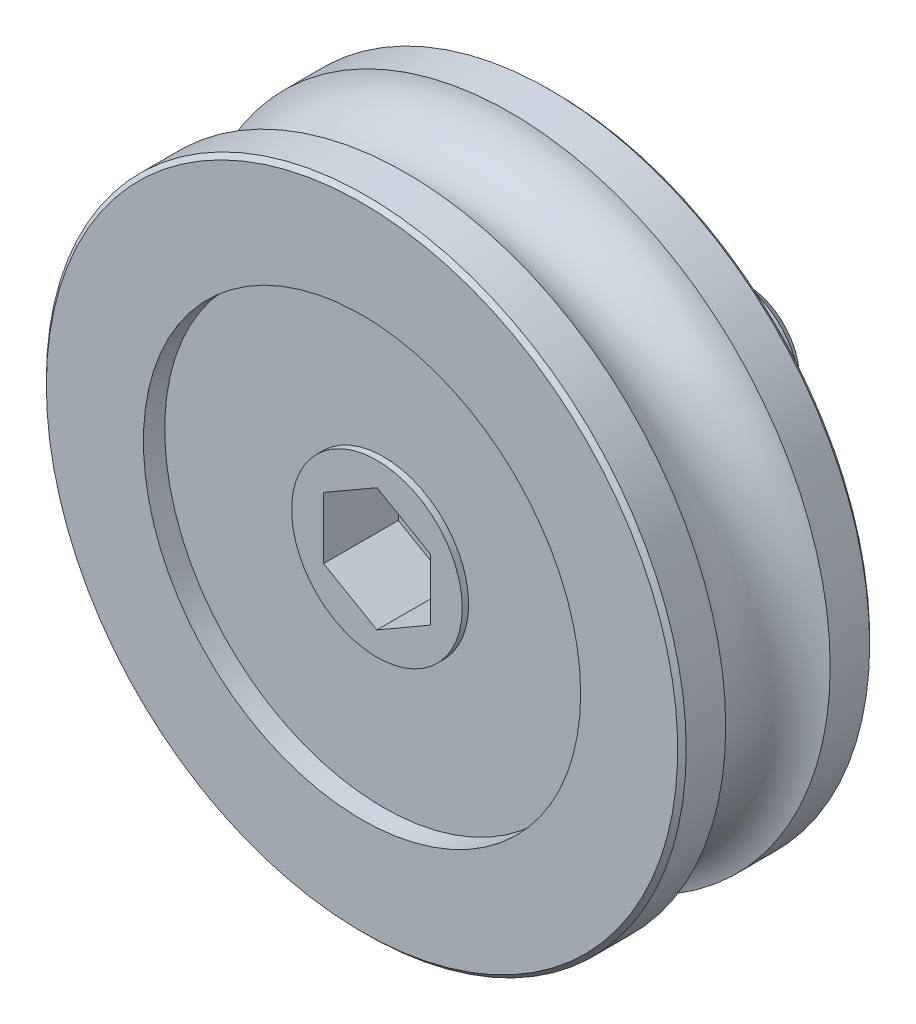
ISO-10303-21;
HEADER;
FILE_DESCRIPTION(('STEP AP214'),'2;1');
FILE_NAME('part.step','',(''),(''),'','','');
FILE_SCHEMA(('AUTOMOTIVE_DESIGN { 1 0 10303 214 1 1 1 1 }'));
ENDSEC;
DATA;
#1=APPLICATION_CONTEXT('core data for automotive mechanical design processes');
#2=APPLICATION_PROTOCOL_DEFINITION('international standard','automotive_design',2000,#1);
#3=PRODUCT_CONTEXT('',#1,'mechanical');
#4=PRODUCT('Part','Part','',(#3));
#5=PRODUCT_RELATED_PRODUCT_CATEGORY('part','',(#4));
#6=PRODUCT_DEFINITION_FORMATION('','',#4);
#7=PRODUCT_DEFINITION_CONTEXT('part definition',#1,'design');
#8=PRODUCT_DEFINITION('design','',#6,#7);
#9=PRODUCT_DEFINITION_SHAPE('','',#8);
#10=(LENGTH_UNIT() NAMED_UNIT(*) SI_UNIT(.MILLI.,.METRE.));
#11=(NAMED_UNIT(*) PLANE_ANGLE_UNIT() SI_UNIT($,.RADIAN.));
#12=(NAMED_UNIT(*) SI_UNIT($,.STERADIAN.) SOLID_ANGLE_UNIT());
#13=UNCERTAINTY_MEASURE_WITH_UNIT(LENGTH_MEASURE(1.E-05),#10,'distance_accuracy_value','');
#14=(GEOMETRIC_REPRESENTATION_CONTEXT(3) GLOBAL_UNCERTAINTY_ASSIGNED_CONTEXT((#13)) GLOBAL_UNIT_ASSIGNED_CONTEXT((#10,
#11,#12)) REPRESENTATION_CONTEXT('',''));
#15=CARTESIAN_POINT('',(0.,0.,0.));
#16=DIRECTION('',(0.,0.,1.));
#17=DIRECTION('',(1.,0.,0.));
#18=AXIS2_PLACEMENT_3D('',#15,#16,#17);
#19=CARTESIAN_POINT('',(0.,12.1794490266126,1.00000000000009));
#20=DIRECTION('',(0.,0.,-1.));
#21=DIRECTION('',(-1.,0.,0.));
#22=AXIS2_PLACEMENT_3D('',#19,#20,#21);
#23=PLANE('',#22);
#24=CARTESIAN_POINT('',(0.,0.,1.00000000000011));
#25=DIRECTION('',(0.,0.,1.));
#26=DIRECTION('',(1.,0.,0.));
#27=AXIS2_PLACEMENT_3D('',#24,#25,#26);
#28=CIRCLE('',#27,10.25);
#29=CARTESIAN_POINT('',(10.25,0.,1.00000000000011));
#30=VERTEX_POINT('',#29);
#31=EDGE_CURVE('E9',#30,#30,#28,.T.);
#32=ORIENTED_EDGE('',*,*,#31,.T.);
#33=EDGE_LOOP('',(#32));
#34=FACE_BOUND('',#33,.T.);
#35=CARTESIAN_POINT('',(0.,0.,1.00000000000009));
#36=DIRECTION('',(0.,0.,-1.));
#37=DIRECTION('',(-1.,0.,0.));
#38=AXIS2_PLACEMENT_3D('',#35,#36,#37);
#39=CIRCLE('',#38,14.8);
#40=CARTESIAN_POINT('',(-14.8,0.,1.00000000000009));
#41=VERTEX_POINT('',#40);
#42=EDGE_CURVE('E103',#41,#41,#39,.T.);
#43=ORIENTED_EDGE('',*,*,#42,.T.);
#44=EDGE_LOOP('',(#43));
#45=FACE_BOUND('',#44,.T.);
#46=ADVANCED_FACE('F14',(#34,#45),#23,.T.);
#47=CARTESIAN_POINT('',(0.,0.,13.));
#48=DIRECTION('',(0.,0.,1.));
#49=DIRECTION('',(1.,0.,0.));
#50=AXIS2_PLACEMENT_3D('',#47,#48,#49);
#51=CYLINDRICAL_SURFACE('',#50,10.25);
#52=CARTESIAN_POINT('',(0.,0.,2.));
#53=DIRECTION('',(0.,0.,1.));
#54=DIRECTION('',(1.,0.,0.));
#55=AXIS2_PLACEMENT_3D('',#52,#53,#54);
#56=CIRCLE('',#55,10.25);
#57=CARTESIAN_POINT('',(10.25,0.,2.));
#58=VERTEX_POINT('',#57);
#59=EDGE_CURVE('E21',#58,#58,#56,.T.);
#60=ORIENTED_EDGE('',*,*,#59,.T.);
#61=EDGE_LOOP('',(#60));
#62=FACE_BOUND('',#61,.T.);
#63=ORIENTED_EDGE('',*,*,#31,.F.);
#64=EDGE_LOOP('',(#63));
#65=FACE_BOUND('',#64,.T.);
#66=ADVANCED_FACE('F156',(#62,#65),#51,.F.);
#67=CARTESIAN_POINT('',(0.,5.1,2.));
#68=DIRECTION('',(0.,0.,-1.));
#69=DIRECTION('',(-1.,0.,0.));
#70=AXIS2_PLACEMENT_3D('',#67,#68,#69);
#71=PLANE('',#70);
#72=CARTESIAN_POINT('',(0.,0.,2.));
#73=DIRECTION('',(0.,0.,1.));
#74=DIRECTION('',(1.,0.,0.));
#75=AXIS2_PLACEMENT_3D('',#72,#73,#74);
#76=CIRCLE('',#75,5.1);
#77=CARTESIAN_POINT('',(5.1,0.,2.));
#78=VERTEX_POINT('',#77);
#79=EDGE_CURVE('E151',#78,#78,#76,.T.);
#80=ORIENTED_EDGE('',*,*,#79,.T.);
#81=EDGE_LOOP('',(#80));
#82=FACE_BOUND('',#81,.T.);
#83=ORIENTED_EDGE('',*,*,#59,.F.);
#84=EDGE_LOOP('',(#83));
#85=FACE_BOUND('',#84,.T.);
#86=ADVANCED_FACE('F159',(#82,#85),#71,.T.);
#87=CARTESIAN_POINT('',(0.,0.,13.));
#88=DIRECTION('',(0.,0.,1.));
#89=DIRECTION('',(1.,0.,0.));
#90=AXIS2_PLACEMENT_3D('',#87,#88,#89);
#91=CYLINDRICAL_SURFACE('',#90,5.1);
#92=CARTESIAN_POINT('',(0.,0.,0.));
#93=DIRECTION('',(0.,0.,1.));
#94=DIRECTION('',(1.,0.,0.));
#95=AXIS2_PLACEMENT_3D('',#92,#93,#94);
#96=CIRCLE('',#95,5.1);
#97=CARTESIAN_POINT('',(5.1,0.,0.));
#98=VERTEX_POINT('',#97);
#99=EDGE_CURVE('E148',#98,#98,#96,.T.);
#100=ORIENTED_EDGE('',*,*,#99,.T.);
#101=EDGE_LOOP('',(#100));
#102=FACE_BOUND('',#101,.T.);
#103=ORIENTED_EDGE('',*,*,#79,.F.);
#104=EDGE_LOOP('',(#103));
#105=FACE_BOUND('',#104,.T.);
#106=ADVANCED_FACE('F161',(#102,#105),#91,.T.);
#107=CARTESIAN_POINT('',(0.,5.1,0.));
#108=DIRECTION('',(0.,0.,-1.));
#109=DIRECTION('',(-1.,0.,0.));
#110=AXIS2_PLACEMENT_3D('',#107,#108,#109);
#111=PLANE('',#110);
#112=CARTESIAN_POINT('',(0.,0.,0.));
#113=DIRECTION('',(0.,0.,1.));
#114=DIRECTION('',(1.,0.,0.));
#115=AXIS2_PLACEMENT_3D('',#112,#113,#114);
#116=CIRCLE('',#115,2.35);
#117=CARTESIAN_POINT('',(2.35,0.,0.));
#118=VERTEX_POINT('',#117);
#119=EDGE_CURVE('E145',#118,#118,#116,.T.);
#120=ORIENTED_EDGE('',*,*,#119,.T.);
#121=EDGE_LOOP('',(#120));
#122=FACE_BOUND('',#121,.T.);
#123=ORIENTED_EDGE('',*,*,#99,.F.);
#124=EDGE_LOOP('',(#123));
#125=FACE_BOUND('',#124,.T.);
#126=ADVANCED_FACE('F169',(#122,#125),#111,.T.);
#127=CARTESIAN_POINT('',(0.,0.,13.));
#128=DIRECTION('',(0.,0.,1.));
#129=DIRECTION('',(1.,0.,0.));
#130=AXIS2_PLACEMENT_3D('',#127,#128,#129);
#131=CYLINDRICAL_SURFACE('',#130,2.35);
#132=CARTESIAN_POINT('',(0.,0.,-2.));
#133=DIRECTION('',(0.,0.,1.));
#134=DIRECTION('',(1.,0.,0.));
#135=AXIS2_PLACEMENT_3D('',#132,#133,#134);
#136=CIRCLE('',#135,2.35);
#137=CARTESIAN_POINT('',(2.35,0.,-2.));
#138=VERTEX_POINT('',#137);
#139=EDGE_CURVE('E142',#138,#138,#136,.T.);
#140=ORIENTED_EDGE('',*,*,#139,.T.);
#141=EDGE_LOOP('',(#140));
#142=FACE_BOUND('',#141,.T.);
#143=ORIENTED_EDGE('',*,*,#119,.F.);
#144=EDGE_LOOP('',(#143));
#145=FACE_BOUND('',#144,.T.);
#146=ADVANCED_FACE('F251',(#142,#145),#131,.T.);
#147=CARTESIAN_POINT('',(0.,2.35,-2.));
#148=DIRECTION('',(0.,0.,1.));
#149=DIRECTION('',(1.,0.,0.));
#150=AXIS2_PLACEMENT_3D('',#147,#148,#149);
#151=PLANE('',#150);
#152=CARTESIAN_POINT('',(0.,0.,-2.));
#153=DIRECTION('',(0.,0.,1.));
#154=DIRECTION('',(1.,0.,0.));
#155=AXIS2_PLACEMENT_3D('',#152,#153,#154);
#156=CIRCLE('',#155,3.);
#157=CARTESIAN_POINT('',(3.,0.,-2.));
#158=VERTEX_POINT('',#157);
#159=EDGE_CURVE('E139',#158,#158,#156,.T.);
#160=ORIENTED_EDGE('',*,*,#159,.T.);
#161=EDGE_LOOP('',(#160));
#162=FACE_BOUND('',#161,.T.);
#163=ORIENTED_EDGE('',*,*,#139,.F.);
#164=EDGE_LOOP('',(#163));
#165=FACE_BOUND('',#164,.T.);
#166=ADVANCED_FACE('F247',(#162,#165),#151,.T.);
#167=CARTESIAN_POINT('',(0.,0.,13.));
#168=DIRECTION('',(0.,0.,1.));
#169=DIRECTION('',(1.,0.,0.));
#170=AXIS2_PLACEMENT_3D('',#167,#168,#169);
#171=CYLINDRICAL_SURFACE('',#170,3.);
#172=CARTESIAN_POINT('',(0.,0.,-7.5));
#173=DIRECTION('',(0.,0.,1.));
#174=DIRECTION('',(1.,0.,0.));
#175=AXIS2_PLACEMENT_3D('',#172,#173,#174);
#176=CIRCLE('',#175,3.);
#177=CARTESIAN_POINT('',(3.,0.,-7.5));
#178=VERTEX_POINT('',#177);
#179=EDGE_CURVE('E136',#178,#178,#176,.T.);
#180=ORIENTED_EDGE('',*,*,#179,.T.);
#181=EDGE_LOOP('',(#180));
#182=FACE_BOUND('',#181,.T.);
#183=ORIENTED_EDGE('',*,*,#159,.F.);
#184=EDGE_LOOP('',(#183));
#185=FACE_BOUND('',#184,.T.);
#186=ADVANCED_FACE('F243',(#182,#185),#171,.T.);
#187=CARTESIAN_POINT('',(0.,0.,-7.5));
#188=DIRECTION('',(0.,0.,1.));
#189=DIRECTION('',(1.,0.,0.));
#190=AXIS2_PLACEMENT_3D('',#187,#188,#189);
#191=CONICAL_SURFACE('',#190,3.,0.785398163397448);
#192=CARTESIAN_POINT('',(0.,0.,-8.));
#193=DIRECTION('',(0.,0.,1.));
#194=DIRECTION('',(1.,0.,0.));
#195=AXIS2_PLACEMENT_3D('',#192,#193,#194);
#196=CIRCLE('',#195,2.5);
#197=CARTESIAN_POINT('',(2.5,0.,-8.));
#198=VERTEX_POINT('',#197);
#199=EDGE_CURVE('E133',#198,#198,#196,.T.);
#200=ORIENTED_EDGE('',*,*,#199,.T.);
#201=EDGE_LOOP('',(#200));
#202=FACE_BOUND('',#201,.T.);
#203=ORIENTED_EDGE('',*,*,#179,.F.);
#204=EDGE_LOOP('',(#203));
#205=FACE_BOUND('',#204,.T.);
#206=ADVANCED_FACE('F239',(#202,#205),#191,.T.);
#207=CARTESIAN_POINT('',(0.,0.,-8.));
#208=DIRECTION('',(0.,0.,-1.));
#209=DIRECTION('',(-1.,0.,0.));
#210=AXIS2_PLACEMENT_3D('',#207,#208,#209);
#211=PLANE('',#210);
#212=ORIENTED_EDGE('',*,*,#199,.F.);
#213=EDGE_LOOP('',(#212));
#214=FACE_BOUND('',#213,.T.);
#215=ADVANCED_FACE('F235',(#214),#211,.T.);
#216=CARTESIAN_POINT('',(0.,0.,1.00000000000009));
#217=DIRECTION('',(0.,0.,1.));
#218=DIRECTION('',(1.,0.,0.));
#219=AXIS2_PLACEMENT_3D('',#216,#217,#218);
#220=CONICAL_SURFACE('',#219,14.8,0.785398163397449);
#221=CARTESIAN_POINT('',(0.,0.,1.20000000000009));
#222=DIRECTION('',(0.,0.,-1.));
#223=DIRECTION('',(-1.,0.,0.));
#224=AXIS2_PLACEMENT_3D('',#221,#222,#223);
#225=CIRCLE('',#224,15.);
#226=CARTESIAN_POINT('',(-15.,0.,1.20000000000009));
#227=VERTEX_POINT('',#226);
#228=EDGE_CURVE('E181',#227,#227,#225,.T.);
#229=ORIENTED_EDGE('',*,*,#228,.T.);
#230=EDGE_LOOP('',(#229));
#231=FACE_BOUND('',#230,.T.);
#232=ORIENTED_EDGE('',*,*,#42,.F.);
#233=EDGE_LOOP('',(#232));
#234=FACE_BOUND('',#233,.T.);
#235=ADVANCED_FACE('F238',(#231,#234),#220,.T.);
#236=CARTESIAN_POINT('',(0.,0.,1.00000000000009));
#237=DIRECTION('',(0.,0.,-1.));
#238=DIRECTION('',(-1.,0.,0.));
#239=AXIS2_PLACEMENT_3D('',#236,#237,#238);
#240=CYLINDRICAL_SURFACE('',#239,15.);
#241=CARTESIAN_POINT('',(0.,0.,3.05051025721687));
#242=DIRECTION('',(0.,0.,-1.));
#243=DIRECTION('',(-1.,0.,0.));
#244=AXIS2_PLACEMENT_3D('',#241,#242,#243);
#245=CIRCLE('',#244,15.);
#246=CARTESIAN_POINT('',(-15.,0.,3.05051025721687));
#247=VERTEX_POINT('',#246);
#248=EDGE_CURVE('E184',#247,#247,#245,.T.);
#249=ORIENTED_EDGE('',*,*,#248,.T.);
#250=EDGE_LOOP('',(#249));
#251=FACE_BOUND('',#250,.T.);
#252=ORIENTED_EDGE('',*,*,#228,.F.);
#253=EDGE_LOOP('',(#252));
#254=FACE_BOUND('',#253,.T.);
#255=ADVANCED_FACE('F302',(#251,#254),#240,.T.);
#256=CARTESIAN_POINT('',(0.,0.,5.5));
#257=DIRECTION('',(0.,0.,-1.));
#258=DIRECTION('',(-1.,0.,0.));
#259=AXIS2_PLACEMENT_3D('',#256,#257,#258);
#260=TOROIDAL_SURFACE('',#259,15.5,2.5);
#261=CARTESIAN_POINT('',(0.,0.,7.94948974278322));
#262=DIRECTION('',(0.,0.,-1.));
#263=DIRECTION('',(-1.,0.,0.));
#264=AXIS2_PLACEMENT_3D('',#261,#262,#263);
#265=CIRCLE('',#264,15.);
#266=CARTESIAN_POINT('',(-15.,0.,7.94948974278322));
#267=VERTEX_POINT('',#266);
#268=EDGE_CURVE('E453',#267,#267,#265,.T.);
#269=ORIENTED_EDGE('',*,*,#268,.T.);
#270=EDGE_LOOP('',(#269));
#271=FACE_BOUND('',#270,.T.);
#272=ORIENTED_EDGE('',*,*,#248,.F.);
#273=EDGE_LOOP('',(#272));
#274=FACE_BOUND('',#273,.T.);
#275=ADVANCED_FACE('F310',(#271,#274),#260,.F.);
#276=CARTESIAN_POINT('',(0.,0.,1.00000000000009));
#277=DIRECTION('',(0.,0.,-1.));
#278=DIRECTION('',(-1.,0.,0.));
#279=AXIS2_PLACEMENT_3D('',#276,#277,#278);
#280=CYLINDRICAL_SURFACE('',#279,15.);
#281=CARTESIAN_POINT('',(0.,0.,9.8));
#282=DIRECTION('',(0.,0.,-1.));
#283=DIRECTION('',(-1.,0.,0.));
#284=AXIS2_PLACEMENT_3D('',#281,#282,#283);
#285=CIRCLE('',#284,15.);
#286=CARTESIAN_POINT('',(-15.,0.,9.8));
#287=VERTEX_POINT('',#286);
#288=EDGE_CURVE('E452',#287,#287,#285,.T.);
#289=ORIENTED_EDGE('',*,*,#288,.T.);
#290=EDGE_LOOP('',(#289));
#291=FACE_BOUND('',#290,.T.);
#292=ORIENTED_EDGE('',*,*,#268,.F.);
#293=EDGE_LOOP('',(#292));
#294=FACE_BOUND('',#293,.T.);
#295=ADVANCED_FACE('F319',(#291,#294),#280,.T.);
#296=CARTESIAN_POINT('',(0.,0.,9.8));
#297=DIRECTION('',(0.,0.,-1.));
#298=DIRECTION('',(-1.,0.,0.));
#299=AXIS2_PLACEMENT_3D('',#296,#297,#298);
#300=CONICAL_SURFACE('',#299,15.,0.785398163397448);
#301=CARTESIAN_POINT('',(0.,0.,10.));
#302=DIRECTION('',(0.,0.,-1.));
#303=DIRECTION('',(-1.,0.,0.));
#304=AXIS2_PLACEMENT_3D('',#301,#302,#303);
#305=CIRCLE('',#304,14.8);
#306=CARTESIAN_POINT('',(-14.8,0.,10.));
#307=VERTEX_POINT('',#306);
#308=EDGE_CURVE('E449',#307,#307,#305,.T.);
#309=ORIENTED_EDGE('',*,*,#308,.T.);
#310=EDGE_LOOP('',(#309));
#311=FACE_BOUND('',#310,.T.);
#312=ORIENTED_EDGE('',*,*,#288,.F.);
#313=EDGE_LOOP('',(#312));
#314=FACE_BOUND('',#313,.T.);
#315=ADVANCED_FACE('F328',(#311,#314),#300,.T.);
#316=CARTESIAN_POINT('',(0.,0.,5.8));
#317=DIRECTION('',(0.,0.,1.));
#318=DIRECTION('',(1.,0.,0.));
#319=AXIS2_PLACEMENT_3D('',#316,#317,#318);
#320=PLANE('',#319);
#321=DIRECTION('',(-0.866025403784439,0.5,0.));
#322=VECTOR('',#321,1.);
#323=CARTESIAN_POINT('',(2.5,1.44337567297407,5.8));
#324=LINE('',#323,#322);
#325=CARTESIAN_POINT('',(2.5,1.44337567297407,5.8));
#326=VERTEX_POINT('',#325);
#327=CARTESIAN_POINT('',(0.,2.88675134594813,5.8));
#328=VERTEX_POINT('',#327);
#329=EDGE_CURVE('E114',#326,#328,#324,.T.);
#330=ORIENTED_EDGE('',*,*,#329,.T.);
#331=DIRECTION('',(-0.866025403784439,-0.5,0.));
#332=VECTOR('',#331,1.);
#333=CARTESIAN_POINT('',(0.,2.88675134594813,5.8));
#334=LINE('',#333,#332);
#335=CARTESIAN_POINT('',(-2.5,1.44337567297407,5.8));
#336=VERTEX_POINT('',#335);
#337=EDGE_CURVE('E96',#328,#336,#334,.T.);
#338=ORIENTED_EDGE('',*,*,#337,.T.);
#339=DIRECTION('',(0.,-1.,0.));
#340=VECTOR('',#339,1.);
#341=CARTESIAN_POINT('',(-2.5,1.44337567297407,5.8));
#342=LINE('',#341,#340);
#343=CARTESIAN_POINT('',(-2.5,-1.44337567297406,5.8));
#344=VERTEX_POINT('',#343);
#345=EDGE_CURVE('E94',#336,#344,#342,.T.);
#346=ORIENTED_EDGE('',*,*,#345,.T.);
#347=DIRECTION('',(0.866025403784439,-0.5,0.));
#348=VECTOR('',#347,1.);
#349=CARTESIAN_POINT('',(-2.5,-1.44337567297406,5.8));
#350=LINE('',#349,#348);
#351=CARTESIAN_POINT('',(0.,-2.88675134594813,5.8));
#352=VERTEX_POINT('',#351);
#353=EDGE_CURVE('E73',#344,#352,#350,.T.);
#354=ORIENTED_EDGE('',*,*,#353,.T.);
#355=DIRECTION('',(0.866025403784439,0.5,0.));
#356=VECTOR('',#355,1.);
#357=CARTESIAN_POINT('',(0.,-2.88675134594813,5.8));
#358=LINE('',#357,#356);
#359=CARTESIAN_POINT('',(2.5,-1.44337567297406,5.8));
#360=VERTEX_POINT('',#359);
#361=EDGE_CURVE('E84',#352,#360,#358,.T.);
#362=ORIENTED_EDGE('',*,*,#361,.T.);
#363=DIRECTION('',(0.,1.,0.));
#364=VECTOR('',#363,1.);
#365=CARTESIAN_POINT('',(2.5,-1.44337567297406,5.8));
#366=LINE('',#365,#364);
#367=EDGE_CURVE('E88',#360,#326,#366,.T.);
#368=ORIENTED_EDGE('',*,*,#367,.T.);
#369=EDGE_LOOP('',(#330,#338,#346,#354,#362,#368));
#370=FACE_BOUND('',#369,.T.);
#371=ADVANCED_FACE('F91',(#370),#320,.T.);
#372=CARTESIAN_POINT('',(0.,2.88675134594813,5.8));
#373=DIRECTION('',(-0.5,0.866025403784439,0.));
#374=DIRECTION('',(-0.866025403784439,-0.5,0.));
#375=AXIS2_PLACEMENT_3D('',#372,#373,#374);
#376=PLANE('',#375);
#377=DIRECTION('',(-0.866025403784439,-0.5,0.));
#378=VECTOR('',#377,1.);
#379=CARTESIAN_POINT('',(0.,2.88675134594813,9.3));
#380=LINE('',#379,#378);
#381=CARTESIAN_POINT('',(0.,2.88675134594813,9.3));
#382=VERTEX_POINT('',#381);
#383=CARTESIAN_POINT('',(-2.5,1.44337567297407,9.3));
#384=VERTEX_POINT('',#383);
#385=EDGE_CURVE('E102',#382,#384,#380,.T.);
#386=ORIENTED_EDGE('',*,*,#385,.T.);
#387=DIRECTION('',(0.,0.,1.));
#388=VECTOR('',#387,1.);
#389=CARTESIAN_POINT('',(-2.5,1.44337567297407,5.8));
#390=LINE('',#389,#388);
#391=EDGE_CURVE('E119',#336,#384,#390,.T.);
#392=ORIENTED_EDGE('',*,*,#391,.F.);
#393=ORIENTED_EDGE('',*,*,#337,.F.);
#394=DIRECTION('',(0.,0.,1.));
#395=VECTOR('',#394,1.);
#396=CARTESIAN_POINT('',(0.,2.88675134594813,5.8));
#397=LINE('',#396,#395);
#398=EDGE_CURVE('E58',#328,#382,#397,.T.);
#399=ORIENTED_EDGE('',*,*,#398,.T.);
#400=EDGE_LOOP('',(#386,#392,#393,#399));
#401=FACE_BOUND('',#400,.T.);
#402=ADVANCED_FACE('F189',(#401),#376,.F.);
#403=CARTESIAN_POINT('',(-2.5,1.44337567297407,5.8));
#404=DIRECTION('',(-1.,0.,0.));
#405=DIRECTION('',(0.,-1.,0.));
#406=AXIS2_PLACEMENT_3D('',#403,#404,#405);
#407=PLANE('',#406);
#408=DIRECTION('',(0.,-1.,0.));
#409=VECTOR('',#408,1.);
#410=CARTESIAN_POINT('',(-2.5,1.44337567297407,9.3));
#411=LINE('',#410,#409);
#412=CARTESIAN_POINT('',(-2.5,-1.44337567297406,9.3));
#413=VERTEX_POINT('',#412);
#414=EDGE_CURVE('E106',#384,#413,#411,.T.);
#415=ORIENTED_EDGE('',*,*,#414,.T.);
#416=DIRECTION('',(0.,0.,1.));
#417=VECTOR('',#416,1.);
#418=CARTESIAN_POINT('',(-2.5,-1.44337567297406,5.8));
#419=LINE('',#418,#417);
#420=EDGE_CURVE('E81',#344,#413,#419,.T.);
#421=ORIENTED_EDGE('',*,*,#420,.F.);
#422=ORIENTED_EDGE('',*,*,#345,.F.);
#423=ORIENTED_EDGE('',*,*,#391,.T.);
#424=EDGE_LOOP('',(#415,#421,#422,#423));
#425=FACE_BOUND('',#424,.T.);
#426=ADVANCED_FACE('F193',(#425),#407,.F.);
#427=CARTESIAN_POINT('',(-2.5,-1.44337567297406,5.8));
#428=DIRECTION('',(-0.5,-0.866025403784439,0.));
#429=DIRECTION('',(0.866025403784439,-0.5,0.));
#430=AXIS2_PLACEMENT_3D('',#427,#428,#429);
#431=PLANE('',#430);
#432=DIRECTION('',(0.866025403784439,-0.5,0.));
#433=VECTOR('',#432,1.);
#434=CARTESIAN_POINT('',(-2.5,-1.44337567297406,9.3));
#435=LINE('',#434,#433);
#436=CARTESIAN_POINT('',(0.,-2.88675134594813,9.3));
#437=VERTEX_POINT('',#436);
#438=EDGE_CURVE('E76',#413,#437,#435,.T.);
#439=ORIENTED_EDGE('',*,*,#438,.T.);
#440=DIRECTION('',(0.,0.,1.));
#441=VECTOR('',#440,1.);
#442=CARTESIAN_POINT('',(0.,-2.88675134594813,5.8));
#443=LINE('',#442,#441);
#444=EDGE_CURVE('E69',#352,#437,#443,.T.);
#445=ORIENTED_EDGE('',*,*,#444,.F.);
#446=ORIENTED_EDGE('',*,*,#353,.F.);
#447=ORIENTED_EDGE('',*,*,#420,.T.);
#448=EDGE_LOOP('',(#439,#445,#446,#447));
#449=FACE_BOUND('',#448,.T.);
#450=ADVANCED_FACE('F71',(#449),#431,.F.);
#451=CARTESIAN_POINT('',(0.,-2.88675134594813,5.8));
#452=DIRECTION('',(0.5,-0.866025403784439,0.));
#453=DIRECTION('',(0.866025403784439,0.5,0.));
#454=AXIS2_PLACEMENT_3D('',#451,#452,#453);
#455=PLANE('',#454);
#456=DIRECTION('',(0.866025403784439,0.5,0.));
#457=VECTOR('',#456,1.);
#458=CARTESIAN_POINT('',(0.,-2.88675134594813,9.3));
#459=LINE('',#458,#457);
#460=CARTESIAN_POINT('',(2.5,-1.44337567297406,9.3));
#461=VERTEX_POINT('',#460);
#462=EDGE_CURVE('E110',#437,#461,#459,.T.);
#463=ORIENTED_EDGE('',*,*,#462,.T.);
#464=DIRECTION('',(0.,0.,1.));
#465=VECTOR('',#464,1.);
#466=CARTESIAN_POINT('',(2.5,-1.44337567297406,5.8));
#467=LINE('',#466,#465);
#468=EDGE_CURVE('E80',#360,#461,#467,.T.);
#469=ORIENTED_EDGE('',*,*,#468,.F.);
#470=ORIENTED_EDGE('',*,*,#361,.F.);
#471=ORIENTED_EDGE('',*,*,#444,.T.);
#472=EDGE_LOOP('',(#463,#469,#470,#471));
#473=FACE_BOUND('',#472,.T.);
#474=ADVANCED_FACE('F85',(#473),#455,.F.);
#475=CARTESIAN_POINT('',(2.5,-1.44337567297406,5.8));
#476=DIRECTION('',(1.,0.,0.));
#477=DIRECTION('',(0.,0.,-1.));
#478=AXIS2_PLACEMENT_3D('',#475,#476,#477);
#479=PLANE('',#478);
#480=DIRECTION('',(0.,1.,0.));
#481=VECTOR('',#480,1.);
#482=CARTESIAN_POINT('',(2.5,-1.44337567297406,9.3));
#483=LINE('',#482,#481);
#484=CARTESIAN_POINT('',(2.5,1.44337567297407,9.3));
#485=VERTEX_POINT('',#484);
#486=EDGE_CURVE('E112',#461,#485,#483,.T.);
#487=ORIENTED_EDGE('',*,*,#486,.T.);
#488=DIRECTION('',(0.,0.,1.));
#489=VECTOR('',#488,1.);
#490=CARTESIAN_POINT('',(2.5,1.44337567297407,5.8));
#491=LINE('',#490,#489);
#492=EDGE_CURVE('E36',#326,#485,#491,.T.);
#493=ORIENTED_EDGE('',*,*,#492,.F.);
#494=ORIENTED_EDGE('',*,*,#367,.F.);
#495=ORIENTED_EDGE('',*,*,#468,.T.);
#496=EDGE_LOOP('',(#487,#493,#494,#495));
#497=FACE_BOUND('',#496,.T.);
#498=ADVANCED_FACE('F198',(#497),#479,.F.);
#499=CARTESIAN_POINT('',(2.5,1.44337567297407,5.8));
#500=DIRECTION('',(0.5,0.866025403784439,0.));
#501=DIRECTION('',(-0.866025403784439,0.5,0.));
#502=AXIS2_PLACEMENT_3D('',#499,#500,#501);
#503=PLANE('',#502);
#504=DIRECTION('',(-0.866025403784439,0.5,0.));
#505=VECTOR('',#504,1.);
#506=CARTESIAN_POINT('',(2.5,1.44337567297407,9.3));
#507=LINE('',#506,#505);
#508=EDGE_CURVE('E28',#485,#382,#507,.T.);
#509=ORIENTED_EDGE('',*,*,#508,.T.);
#510=ORIENTED_EDGE('',*,*,#398,.F.);
#511=ORIENTED_EDGE('',*,*,#329,.F.);
#512=ORIENTED_EDGE('',*,*,#492,.T.);
#513=EDGE_LOOP('',(#509,#510,#511,#512));
#514=FACE_BOUND('',#513,.T.);
#515=ADVANCED_FACE('F200',(#514),#503,.F.);
#516=CARTESIAN_POINT('',(0.,4.0000000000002,9.3));
#517=DIRECTION('',(0.,0.,1.));
#518=DIRECTION('',(1.,0.,0.));
#519=AXIS2_PLACEMENT_3D('',#516,#517,#518);
#520=PLANE('',#519);
#521=ORIENTED_EDGE('',*,*,#508,.F.);
#522=ORIENTED_EDGE('',*,*,#486,.F.);
#523=ORIENTED_EDGE('',*,*,#462,.F.);
#524=ORIENTED_EDGE('',*,*,#438,.F.);
#525=ORIENTED_EDGE('',*,*,#414,.F.);
#526=ORIENTED_EDGE('',*,*,#385,.F.);
#527=EDGE_LOOP('',(#521,#522,#523,#524,#525,#526));
#528=FACE_BOUND('',#527,.T.);
#529=CARTESIAN_POINT('',(0.,0.,9.3));
#530=DIRECTION('',(0.,0.,1.));
#531=DIRECTION('',(1.,0.,0.));
#532=AXIS2_PLACEMENT_3D('',#529,#530,#531);
#533=CIRCLE('',#532,4.0000000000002);
#534=CARTESIAN_POINT('',(4.0000000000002,0.,9.3));
#535=VERTEX_POINT('',#534);
#536=EDGE_CURVE('E130',#535,#535,#533,.T.);
#537=ORIENTED_EDGE('',*,*,#536,.T.);
#538=EDGE_LOOP('',(#537));
#539=FACE_BOUND('',#538,.T.);
#540=ADVANCED_FACE('F195',(#528,#539),#520,.T.);
#541=CARTESIAN_POINT('',(0.,0.,13.));
#542=DIRECTION('',(0.,0.,1.));
#543=DIRECTION('',(1.,0.,0.));
#544=AXIS2_PLACEMENT_3D('',#541,#542,#543);
#545=CYLINDRICAL_SURFACE('',#544,4.0000000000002);
#546=CARTESIAN_POINT('',(0.,0.,8.99999999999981));
#547=DIRECTION('',(0.,0.,1.));
#548=DIRECTION('',(1.,0.,0.));
#549=AXIS2_PLACEMENT_3D('',#546,#547,#548);
#550=CIRCLE('',#549,4.0000000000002);
#551=CARTESIAN_POINT('',(4.0000000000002,0.,8.99999999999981));
#552=VERTEX_POINT('',#551);
#553=EDGE_CURVE('E127',#552,#552,#550,.T.);
#554=ORIENTED_EDGE('',*,*,#553,.T.);
#555=EDGE_LOOP('',(#554));
#556=FACE_BOUND('',#555,.T.);
#557=ORIENTED_EDGE('',*,*,#536,.F.);
#558=EDGE_LOOP('',(#557));
#559=FACE_BOUND('',#558,.T.);
#560=ADVANCED_FACE('F228',(#556,#559),#545,.T.);
#561=CARTESIAN_POINT('',(0.,10.25,9.));
#562=DIRECTION('',(0.,0.,1.));
#563=DIRECTION('',(1.,0.,0.));
#564=AXIS2_PLACEMENT_3D('',#561,#562,#563);
#565=PLANE('',#564);
#566=CARTESIAN_POINT('',(0.,0.,9.));
#567=DIRECTION('',(0.,0.,1.));
#568=DIRECTION('',(1.,0.,0.));
#569=AXIS2_PLACEMENT_3D('',#566,#567,#568);
#570=CIRCLE('',#569,10.25);
#571=CARTESIAN_POINT('',(10.25,0.,9.));
#572=VERTEX_POINT('',#571);
#573=EDGE_CURVE('E124',#572,#572,#570,.T.);
#574=ORIENTED_EDGE('',*,*,#573,.T.);
#575=EDGE_LOOP('',(#574));
#576=FACE_BOUND('',#575,.T.);
#577=ORIENTED_EDGE('',*,*,#553,.F.);
#578=EDGE_LOOP('',(#577));
#579=FACE_BOUND('',#578,.T.);
#580=ADVANCED_FACE('F224',(#576,#579),#565,.T.);
#581=CARTESIAN_POINT('',(0.,0.,13.));
#582=DIRECTION('',(0.,0.,1.));
#583=DIRECTION('',(1.,0.,0.));
#584=AXIS2_PLACEMENT_3D('',#581,#582,#583);
#585=CYLINDRICAL_SURFACE('',#584,10.25);
#586=CARTESIAN_POINT('',(0.,0.,10.));
#587=DIRECTION('',(0.,0.,1.));
#588=DIRECTION('',(1.,0.,0.));
#589=AXIS2_PLACEMENT_3D('',#586,#587,#588);
#590=CIRCLE('',#589,10.25);
#591=CARTESIAN_POINT('',(10.25,0.,10.));
#592=VERTEX_POINT('',#591);
#593=EDGE_CURVE('E116',#592,#592,#590,.T.);
#594=ORIENTED_EDGE('',*,*,#593,.T.);
#595=EDGE_LOOP('',(#594));
#596=FACE_BOUND('',#595,.T.);
#597=ORIENTED_EDGE('',*,*,#573,.F.);
#598=EDGE_LOOP('',(#597));
#599=FACE_BOUND('',#598,.T.);
#600=ADVANCED_FACE('F220',(#596,#599),#585,.F.);
#601=CARTESIAN_POINT('',(0.,12.1794489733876,10.));
#602=DIRECTION('',(0.,0.,1.));
#603=DIRECTION('',(1.,0.,0.));
#604=AXIS2_PLACEMENT_3D('',#601,#602,#603);
#605=PLANE('',#604);
#606=ORIENTED_EDGE('',*,*,#593,.F.);
#607=EDGE_LOOP('',(#606));
#608=FACE_BOUND('',#607,.T.);
#609=ORIENTED_EDGE('',*,*,#308,.F.);
#610=EDGE_LOOP('',(#609));
#611=FACE_BOUND('',#610,.T.);
#612=ADVANCED_FACE('F217',(#608,#611),#605,.T.);
#613=CLOSED_SHELL('',(#46,#66,#86,#106,#126,#146,#166,#186,#206,#215,#235,#255,#275,#295,#315,
#371,#402,#426,#450,#474,#498,#515,#540,#560,#580,#600,#612));
#614=MANIFOLD_SOLID_BREP('B1',#613);
#615=ADVANCED_BREP_SHAPE_REPRESENTATION('',(#18,#614),#14);
#616=SHAPE_DEFINITION_REPRESENTATION(#9,#615);
ENDSEC;
END-ISO-10303-21;
